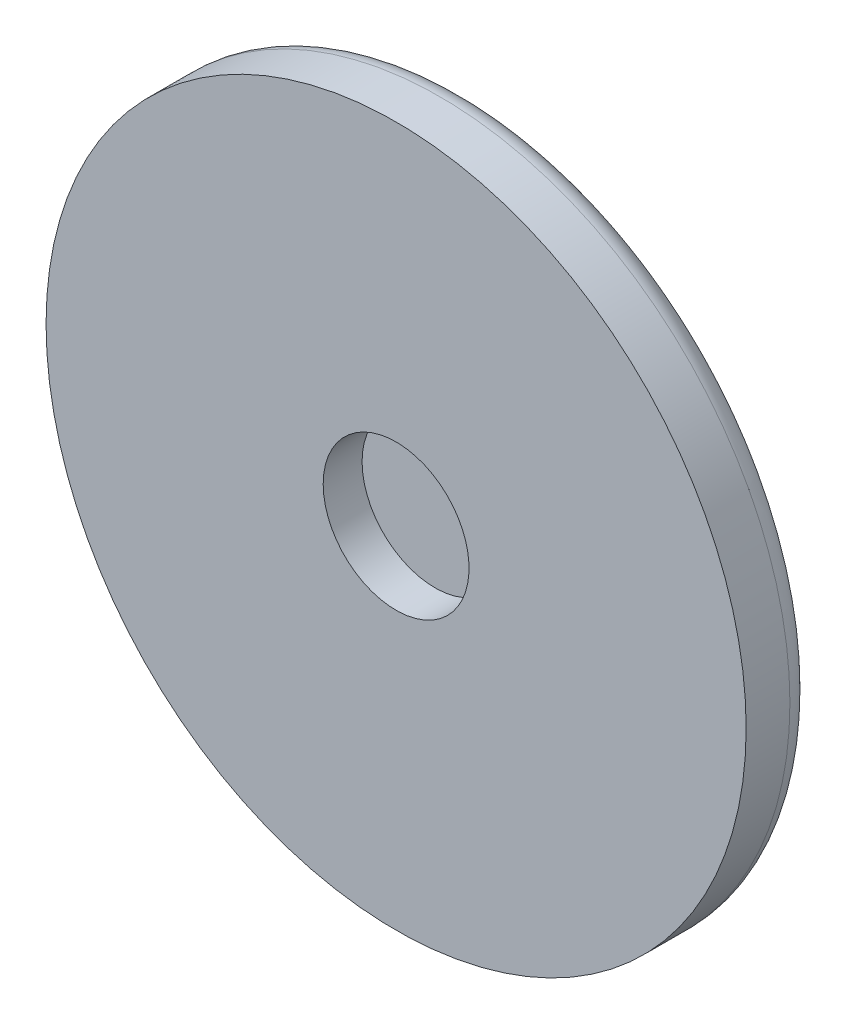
ISO-10303-21;
HEADER;
FILE_DESCRIPTION(('STEP AP214'),'2;1');
FILE_NAME('part.step','',(''),(''),'','','');
FILE_SCHEMA(('AUTOMOTIVE_DESIGN { 1 0 10303 214 1 1 1 1 }'));
ENDSEC;
DATA;
#1=APPLICATION_CONTEXT('core data for automotive mechanical design processes');
#2=APPLICATION_PROTOCOL_DEFINITION('international standard','automotive_design',2000,#1);
#3=PRODUCT_CONTEXT('',#1,'mechanical');
#4=PRODUCT('Part','Part','',(#3));
#5=PRODUCT_RELATED_PRODUCT_CATEGORY('part','',(#4));
#6=PRODUCT_DEFINITION_FORMATION('','',#4);
#7=PRODUCT_DEFINITION_CONTEXT('part definition',#1,'design');
#8=PRODUCT_DEFINITION('design','',#6,#7);
#9=PRODUCT_DEFINITION_SHAPE('','',#8);
#10=(LENGTH_UNIT() NAMED_UNIT(*) SI_UNIT(.MILLI.,.METRE.));
#11=(NAMED_UNIT(*) PLANE_ANGLE_UNIT() SI_UNIT($,.RADIAN.));
#12=(NAMED_UNIT(*) SI_UNIT($,.STERADIAN.) SOLID_ANGLE_UNIT());
#13=UNCERTAINTY_MEASURE_WITH_UNIT(LENGTH_MEASURE(1.E-05),#10,'distance_accuracy_value','');
#14=(GEOMETRIC_REPRESENTATION_CONTEXT(3) GLOBAL_UNCERTAINTY_ASSIGNED_CONTEXT((#13)) GLOBAL_UNIT_ASSIGNED_CONTEXT((#10,
#11,#12)) REPRESENTATION_CONTEXT('',''));
#15=CARTESIAN_POINT('',(0.,0.,0.));
#16=DIRECTION('',(0.,0.,1.));
#17=DIRECTION('',(1.,0.,0.));
#18=AXIS2_PLACEMENT_3D('',#15,#16,#17);
#19=CARTESIAN_POINT('',(0.,0.,0.));
#20=DIRECTION('',(0.,0.,-1.));
#21=DIRECTION('',(-1.,0.,0.));
#22=AXIS2_PLACEMENT_3D('',#19,#20,#21);
#23=PLANE('',#22);
#24=CARTESIAN_POINT('',(0.,0.,0.));
#25=DIRECTION('',(0.,0.,1.));
#26=DIRECTION('',(1.,0.,0.));
#27=AXIS2_PLACEMENT_3D('',#24,#25,#26);
#28=CIRCLE('',#27,33.5);
#29=CARTESIAN_POINT('',(33.5,0.,0.));
#30=VERTEX_POINT('',#29);
#31=EDGE_CURVE('E52',#30,#30,#28,.T.);
#32=ORIENTED_EDGE('',*,*,#31,.F.);
#33=EDGE_LOOP('',(#32));
#34=FACE_BOUND('',#33,.T.);
#35=ADVANCED_FACE('F13',(#34),#23,.T.);
#36=CARTESIAN_POINT('',(0.,0.,2.5));
#37=DIRECTION('',(0.,0.,-1.));
#38=DIRECTION('',(-1.,0.,0.));
#39=AXIS2_PLACEMENT_3D('',#36,#37,#38);
#40=TOROIDAL_SURFACE('',#39,33.5,2.5);
#41=ORIENTED_EDGE('',*,*,#31,.T.);
#42=EDGE_LOOP('',(#41));
#43=FACE_BOUND('',#42,.T.);
#44=CARTESIAN_POINT('',(0.,0.,2.5));
#45=DIRECTION('',(0.,0.,1.));
#46=DIRECTION('',(1.,0.,0.));
#47=AXIS2_PLACEMENT_3D('',#44,#45,#46);
#48=CIRCLE('',#47,36.);
#49=CARTESIAN_POINT('',(36.,0.,2.5));
#50=VERTEX_POINT('',#49);
#51=EDGE_CURVE('E60',#50,#50,#48,.T.);
#52=ORIENTED_EDGE('',*,*,#51,.F.);
#53=EDGE_LOOP('',(#52));
#54=FACE_BOUND('',#53,.T.);
#55=ADVANCED_FACE('F32',(#43,#54),#40,.T.);
#56=CARTESIAN_POINT('',(0.,0.,3.));
#57=DIRECTION('',(0.,0.,-1.));
#58=DIRECTION('',(-1.,0.,0.));
#59=AXIS2_PLACEMENT_3D('',#56,#57,#58);
#60=PLANE('',#59);
#61=CARTESIAN_POINT('',(0.,0.,3.));
#62=DIRECTION('',(0.,0.,-1.));
#63=DIRECTION('',(-1.,0.,0.));
#64=AXIS2_PLACEMENT_3D('',#61,#62,#63);
#65=CIRCLE('',#64,7.5);
#66=CARTESIAN_POINT('',(-7.5,0.,3.));
#67=VERTEX_POINT('',#66);
#68=EDGE_CURVE('E17',#67,#67,#65,.F.);
#69=ORIENTED_EDGE('',*,*,#68,.T.);
#70=EDGE_LOOP('',(#69));
#71=FACE_BOUND('',#70,.T.);
#72=ADVANCED_FACE('F42',(#71),#60,.F.);
#73=CARTESIAN_POINT('',(0.,0.,0.));
#74=DIRECTION('',(0.,0.,1.));
#75=DIRECTION('',(1.,0.,0.));
#76=AXIS2_PLACEMENT_3D('',#73,#74,#75);
#77=CYLINDRICAL_SURFACE('',#76,36.);
#78=ORIENTED_EDGE('',*,*,#51,.T.);
#79=EDGE_LOOP('',(#78));
#80=FACE_BOUND('',#79,.T.);
#81=CARTESIAN_POINT('',(0.,0.,7.));
#82=DIRECTION('',(0.,0.,1.));
#83=DIRECTION('',(1.,0.,0.));
#84=AXIS2_PLACEMENT_3D('',#81,#82,#83);
#85=CIRCLE('',#84,36.);
#86=CARTESIAN_POINT('',(36.,0.,7.));
#87=VERTEX_POINT('',#86);
#88=EDGE_CURVE('E21',#87,#87,#85,.F.);
#89=ORIENTED_EDGE('',*,*,#88,.T.);
#90=EDGE_LOOP('',(#89));
#91=FACE_BOUND('',#90,.T.);
#92=ADVANCED_FACE('F71',(#80,#91),#77,.T.);
#93=CARTESIAN_POINT('',(0.,0.,7.));
#94=DIRECTION('',(0.,0.,-1.));
#95=DIRECTION('',(-1.,0.,0.));
#96=AXIS2_PLACEMENT_3D('',#93,#94,#95);
#97=CYLINDRICAL_SURFACE('',#96,7.5);
#98=CARTESIAN_POINT('',(0.,0.,7.));
#99=DIRECTION('',(0.,0.,-1.));
#100=DIRECTION('',(-1.,0.,0.));
#101=AXIS2_PLACEMENT_3D('',#98,#99,#100);
#102=CIRCLE('',#101,7.5);
#103=CARTESIAN_POINT('',(-7.5,0.,7.));
#104=VERTEX_POINT('',#103);
#105=EDGE_CURVE('E9',#104,#104,#102,.F.);
#106=ORIENTED_EDGE('',*,*,#105,.T.);
#107=EDGE_LOOP('',(#106));
#108=FACE_BOUND('',#107,.T.);
#109=ORIENTED_EDGE('',*,*,#68,.F.);
#110=EDGE_LOOP('',(#109));
#111=FACE_BOUND('',#110,.T.);
#112=ADVANCED_FACE('F68',(#108,#111),#97,.F.);
#113=CARTESIAN_POINT('',(0.,0.,7.));
#114=DIRECTION('',(0.,0.,-1.));
#115=DIRECTION('',(-1.,0.,0.));
#116=AXIS2_PLACEMENT_3D('',#113,#114,#115);
#117=PLANE('',#116);
#118=ORIENTED_EDGE('',*,*,#105,.F.);
#119=EDGE_LOOP('',(#118));
#120=FACE_BOUND('',#119,.T.);
#121=ORIENTED_EDGE('',*,*,#88,.F.);
#122=EDGE_LOOP('',(#121));
#123=FACE_BOUND('',#122,.T.);
#124=ADVANCED_FACE('F70',(#120,#123),#117,.F.);
#125=CLOSED_SHELL('',(#35,#55,#72,#92,#112,#124));
#126=MANIFOLD_SOLID_BREP('B1',#125);
#127=ADVANCED_BREP_SHAPE_REPRESENTATION('',(#18,#126),#14);
#128=SHAPE_DEFINITION_REPRESENTATION(#9,#127);
ENDSEC;
END-ISO-10303-21;
